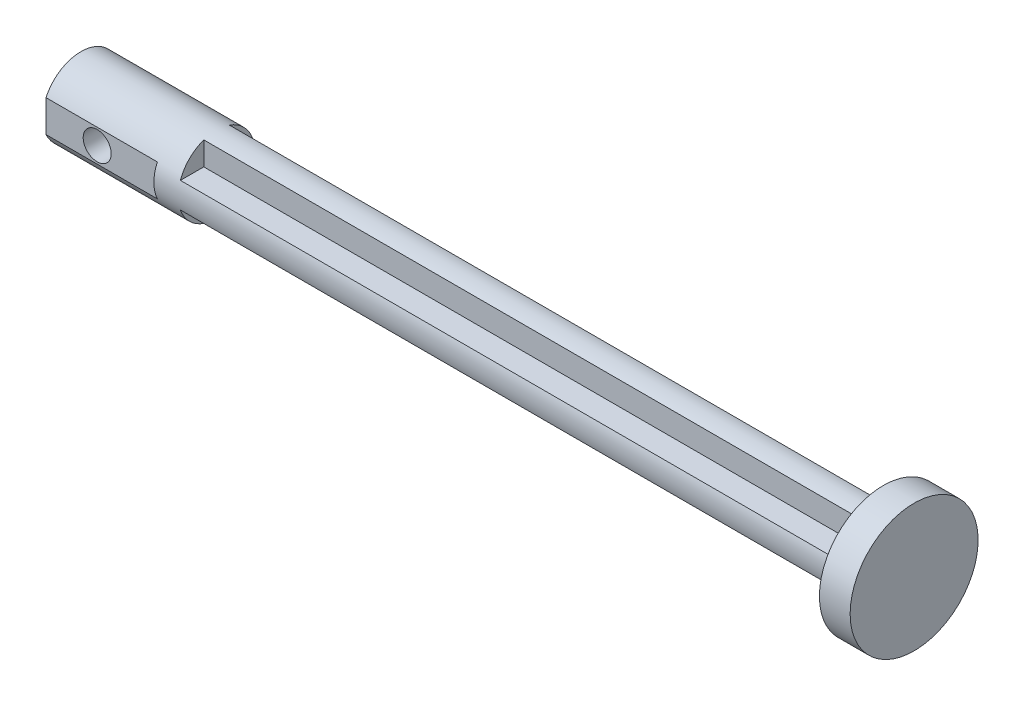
ISO-10303-21;
HEADER;
FILE_DESCRIPTION(('STEP AP214'),'2;1');
FILE_NAME('part.step','',(''),(''),'','','');
FILE_SCHEMA(('AUTOMOTIVE_DESIGN { 1 0 10303 214 1 1 1 1 }'));
ENDSEC;
DATA;
#1=APPLICATION_CONTEXT('core data for automotive mechanical design processes');
#2=APPLICATION_PROTOCOL_DEFINITION('international standard','automotive_design',2000,#1);
#3=PRODUCT_CONTEXT('',#1,'mechanical');
#4=PRODUCT('Part','Part','',(#3));
#5=PRODUCT_RELATED_PRODUCT_CATEGORY('part','',(#4));
#6=PRODUCT_DEFINITION_FORMATION('','',#4);
#7=PRODUCT_DEFINITION_CONTEXT('part definition',#1,'design');
#8=PRODUCT_DEFINITION('design','',#6,#7);
#9=PRODUCT_DEFINITION_SHAPE('','',#8);
#10=(LENGTH_UNIT() NAMED_UNIT(*) SI_UNIT(.MILLI.,.METRE.));
#11=(NAMED_UNIT(*) PLANE_ANGLE_UNIT() SI_UNIT($,.RADIAN.));
#12=(NAMED_UNIT(*) SI_UNIT($,.STERADIAN.) SOLID_ANGLE_UNIT());
#13=UNCERTAINTY_MEASURE_WITH_UNIT(LENGTH_MEASURE(1.E-05),#10,'distance_accuracy_value','');
#14=(GEOMETRIC_REPRESENTATION_CONTEXT(3) GLOBAL_UNCERTAINTY_ASSIGNED_CONTEXT((#13)) GLOBAL_UNIT_ASSIGNED_CONTEXT((#10,
#11,#12)) REPRESENTATION_CONTEXT('',''));
#15=CARTESIAN_POINT('',(0.,0.,0.));
#16=DIRECTION('',(0.,0.,1.));
#17=DIRECTION('',(1.,0.,0.));
#18=AXIS2_PLACEMENT_3D('',#15,#16,#17);
#19=CARTESIAN_POINT('',(13.462,0.,0.));
#20=DIRECTION('',(1.,0.,0.));
#21=DIRECTION('',(0.,0.,-1.));
#22=AXIS2_PLACEMENT_3D('',#19,#20,#21);
#23=PLANE('',#22);
#24=DIRECTION('',(0.,1.,0.));
#25=VECTOR('',#24,1.);
#26=CARTESIAN_POINT('',(13.462,1.27,-1.27));
#27=LINE('',#26,#25);
#28=CARTESIAN_POINT('',(13.462,1.27,-1.27));
#29=VERTEX_POINT('',#28);
#30=CARTESIAN_POINT('',(13.462,3.59210244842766,-1.27));
#31=VERTEX_POINT('',#30);
#32=EDGE_CURVE('E53',#29,#31,#27,.T.);
#33=ORIENTED_EDGE('',*,*,#32,.F.);
#34=DIRECTION('',(0.,0.,1.));
#35=VECTOR('',#34,1.);
#36=CARTESIAN_POINT('',(13.462,1.27,-3.59210244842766));
#37=LINE('',#36,#35);
#38=CARTESIAN_POINT('',(13.462,1.27,-3.59210244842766));
#39=VERTEX_POINT('',#38);
#40=EDGE_CURVE('E185',#39,#29,#37,.T.);
#41=ORIENTED_EDGE('',*,*,#40,.F.);
#42=CARTESIAN_POINT('',(13.462,0.,0.));
#43=DIRECTION('',(1.,0.,0.));
#44=DIRECTION('',(0.,0.,-1.));
#45=AXIS2_PLACEMENT_3D('',#42,#43,#44);
#46=CIRCLE('',#45,3.81);
#47=EDGE_CURVE('E11',#39,#31,#46,.T.);
#48=ORIENTED_EDGE('',*,*,#47,.T.);
#49=EDGE_LOOP('',(#33,#41,#48));
#50=FACE_BOUND('',#49,.T.);
#51=ADVANCED_FACE('F28',(#50),#23,.T.);
#52=DIRECTION('',(0.,0.,-1.));
#53=VECTOR('',#52,1.);
#54=CARTESIAN_POINT('',(13.462,-1.27,-1.27));
#55=LINE('',#54,#53);
#56=CARTESIAN_POINT('',(13.462,-1.27,-1.27));
#57=VERTEX_POINT('',#56);
#58=CARTESIAN_POINT('',(13.462,-1.27,-3.59210244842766));
#59=VERTEX_POINT('',#58);
#60=EDGE_CURVE('E195',#57,#59,#55,.T.);
#61=ORIENTED_EDGE('',*,*,#60,.F.);
#62=DIRECTION('',(0.,1.,0.));
#63=VECTOR('',#62,1.);
#64=CARTESIAN_POINT('',(13.462,-3.59210244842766,-1.27));
#65=LINE('',#64,#63);
#66=CARTESIAN_POINT('',(13.462,-3.59210244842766,-1.27));
#67=VERTEX_POINT('',#66);
#68=EDGE_CURVE('E203',#67,#57,#65,.T.);
#69=ORIENTED_EDGE('',*,*,#68,.F.);
#70=EDGE_CURVE('E146',#67,#59,#46,.T.);
#71=ORIENTED_EDGE('',*,*,#70,.T.);
#72=EDGE_LOOP('',(#61,#69,#71));
#73=FACE_BOUND('',#72,.T.);
#74=ADVANCED_FACE('F260',(#73),#23,.T.);
#75=DIRECTION('',(0.,-1.,0.));
#76=VECTOR('',#75,1.);
#77=CARTESIAN_POINT('',(13.462,-1.27,1.27));
#78=LINE('',#77,#76);
#79=CARTESIAN_POINT('',(13.462,-1.27,1.27));
#80=VERTEX_POINT('',#79);
#81=CARTESIAN_POINT('',(13.462,-3.59210244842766,1.27));
#82=VERTEX_POINT('',#81);
#83=EDGE_CURVE('E216',#80,#82,#78,.T.);
#84=ORIENTED_EDGE('',*,*,#83,.F.);
#85=DIRECTION('',(0.,0.,-1.));
#86=VECTOR('',#85,1.);
#87=CARTESIAN_POINT('',(13.462,-1.27,3.59210244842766));
#88=LINE('',#87,#86);
#89=CARTESIAN_POINT('',(13.462,-1.27,3.59210244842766));
#90=VERTEX_POINT('',#89);
#91=EDGE_CURVE('E222',#90,#80,#88,.T.);
#92=ORIENTED_EDGE('',*,*,#91,.F.);
#93=EDGE_CURVE('E149',#90,#82,#46,.T.);
#94=ORIENTED_EDGE('',*,*,#93,.T.);
#95=EDGE_LOOP('',(#84,#92,#94));
#96=FACE_BOUND('',#95,.T.);
#97=ADVANCED_FACE('F311',(#96),#23,.T.);
#98=CARTESIAN_POINT('',(13.462,0.,0.));
#99=DIRECTION('',(-1.,0.,0.));
#100=DIRECTION('',(0.,0.,1.));
#101=AXIS2_PLACEMENT_3D('',#98,#99,#100);
#102=CYLINDRICAL_SURFACE('',#101,3.81);
#103=ORIENTED_EDGE('',*,*,#47,.F.);
#104=DIRECTION('',(-1.,0.,0.));
#105=VECTOR('',#104,1.);
#106=CARTESIAN_POINT('',(90.405307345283,1.27,-3.59210244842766));
#107=LINE('',#106,#105);
#108=CARTESIAN_POINT('',(79.629,1.27,-3.59210244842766));
#109=VERTEX_POINT('',#108);
#110=EDGE_CURVE('E266',#109,#39,#107,.T.);
#111=ORIENTED_EDGE('',*,*,#110,.F.);
#112=CARTESIAN_POINT('',(79.629,0.,0.));
#113=DIRECTION('',(1.,0.,0.));
#114=DIRECTION('',(0.,0.,-1.));
#115=AXIS2_PLACEMENT_3D('',#112,#113,#114);
#116=CIRCLE('',#115,3.81);
#117=CARTESIAN_POINT('',(79.629,-1.27,-3.59210244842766));
#118=VERTEX_POINT('',#117);
#119=EDGE_CURVE('E152',#118,#109,#116,.T.);
#120=ORIENTED_EDGE('',*,*,#119,.F.);
#121=DIRECTION('',(-1.,0.,0.));
#122=VECTOR('',#121,1.);
#123=CARTESIAN_POINT('',(90.405307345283,-1.27,-3.59210244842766));
#124=LINE('',#123,#122);
#125=EDGE_CURVE('E199',#118,#59,#124,.T.);
#126=ORIENTED_EDGE('',*,*,#125,.T.);
#127=ORIENTED_EDGE('',*,*,#70,.F.);
#128=DIRECTION('',(-1.,0.,0.));
#129=VECTOR('',#128,1.);
#130=CARTESIAN_POINT('',(90.405307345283,-3.59210244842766,-1.27));
#131=LINE('',#130,#129);
#132=CARTESIAN_POINT('',(79.629,-3.59210244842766,-1.27));
#133=VERTEX_POINT('',#132);
#134=EDGE_CURVE('E206',#133,#67,#131,.T.);
#135=ORIENTED_EDGE('',*,*,#134,.F.);
#136=CARTESIAN_POINT('',(79.629,0.,0.));
#137=DIRECTION('',(1.,0.,0.));
#138=DIRECTION('',(0.,0.,-1.));
#139=AXIS2_PLACEMENT_3D('',#136,#137,#138);
#140=CIRCLE('',#139,3.81);
#141=CARTESIAN_POINT('',(79.629,-3.59210244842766,1.27));
#142=VERTEX_POINT('',#141);
#143=EDGE_CURVE('E288',#142,#133,#140,.T.);
#144=ORIENTED_EDGE('',*,*,#143,.F.);
#145=DIRECTION('',(-1.,0.,0.));
#146=VECTOR('',#145,1.);
#147=CARTESIAN_POINT('',(90.405307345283,-3.59210244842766,1.27));
#148=LINE('',#147,#146);
#149=EDGE_CURVE('E211',#142,#82,#148,.T.);
#150=ORIENTED_EDGE('',*,*,#149,.T.);
#151=ORIENTED_EDGE('',*,*,#93,.F.);
#152=DIRECTION('',(-1.,0.,0.));
#153=VECTOR('',#152,1.);
#154=CARTESIAN_POINT('',(90.405307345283,-1.27,3.59210244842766));
#155=LINE('',#154,#153);
#156=CARTESIAN_POINT('',(79.629,-1.27,3.59210244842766));
#157=VERTEX_POINT('',#156);
#158=EDGE_CURVE('E225',#157,#90,#155,.T.);
#159=ORIENTED_EDGE('',*,*,#158,.F.);
#160=CARTESIAN_POINT('',(79.629,0.,0.));
#161=DIRECTION('',(1.,0.,0.));
#162=DIRECTION('',(0.,0.,-1.));
#163=AXIS2_PLACEMENT_3D('',#160,#161,#162);
#164=CIRCLE('',#163,3.81);
#165=CARTESIAN_POINT('',(79.629,1.27,3.59210244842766));
#166=VERTEX_POINT('',#165);
#167=EDGE_CURVE('E296',#166,#157,#164,.T.);
#168=ORIENTED_EDGE('',*,*,#167,.F.);
#169=DIRECTION('',(-1.,0.,0.));
#170=VECTOR('',#169,1.);
#171=CARTESIAN_POINT('',(90.405307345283,1.27,3.59210244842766));
#172=LINE('',#171,#170);
#173=CARTESIAN_POINT('',(13.462,1.27,3.59210244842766));
#174=VERTEX_POINT('',#173);
#175=EDGE_CURVE('E230',#166,#174,#172,.T.);
#176=ORIENTED_EDGE('',*,*,#175,.T.);
#177=CARTESIAN_POINT('',(13.462,3.59210244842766,1.27));
#178=VERTEX_POINT('',#177);
#179=EDGE_CURVE('E38',#178,#174,#46,.T.);
#180=ORIENTED_EDGE('',*,*,#179,.F.);
#181=DIRECTION('',(-1.,0.,0.));
#182=VECTOR('',#181,1.);
#183=CARTESIAN_POINT('',(90.405307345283,3.59210244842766,1.27));
#184=LINE('',#183,#182);
#185=CARTESIAN_POINT('',(79.629,3.59210244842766,1.27));
#186=VERTEX_POINT('',#185);
#187=EDGE_CURVE('E169',#186,#178,#184,.T.);
#188=ORIENTED_EDGE('',*,*,#187,.F.);
#189=CARTESIAN_POINT('',(79.629,0.,0.));
#190=DIRECTION('',(1.,0.,0.));
#191=DIRECTION('',(0.,0.,-1.));
#192=AXIS2_PLACEMENT_3D('',#189,#190,#191);
#193=CIRCLE('',#192,3.81);
#194=CARTESIAN_POINT('',(79.629,3.59210244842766,-1.27));
#195=VERTEX_POINT('',#194);
#196=EDGE_CURVE('E303',#195,#186,#193,.T.);
#197=ORIENTED_EDGE('',*,*,#196,.F.);
#198=DIRECTION('',(-1.,0.,0.));
#199=VECTOR('',#198,1.);
#200=CARTESIAN_POINT('',(90.405307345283,3.59210244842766,-1.27));
#201=LINE('',#200,#199);
#202=EDGE_CURVE('E174',#195,#31,#201,.T.);
#203=ORIENTED_EDGE('',*,*,#202,.T.);
#204=EDGE_LOOP('',(#103,#111,#120,#126,#127,#135,#144,#150,#151,#159,#168,#176,#180,#188,#197,#203));
#205=FACE_BOUND('',#204,.T.);
#206=CARTESIAN_POINT('',(11.049,0.,0.));
#207=DIRECTION('',(-1.,0.,0.));
#208=DIRECTION('',(0.,0.,1.));
#209=AXIS2_PLACEMENT_3D('',#206,#207,#208);
#210=CIRCLE('',#209,3.81);
#211=CARTESIAN_POINT('',(11.049,-1.5875,3.46351609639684));
#212=VERTEX_POINT('',#211);
#213=CARTESIAN_POINT('',(11.049,1.5875,3.46351609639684));
#214=VERTEX_POINT('',#213);
#215=EDGE_CURVE('E137',#212,#214,#210,.T.);
#216=ORIENTED_EDGE('',*,*,#215,.F.);
#217=DIRECTION('',(-1.,0.,0.));
#218=VECTOR('',#217,1.);
#219=CARTESIAN_POINT('',(11.049,-1.5875,3.46351609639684));
#220=LINE('',#219,#218);
#221=CARTESIAN_POINT('',(0.,-1.5875,3.46351609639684));
#222=VERTEX_POINT('',#221);
#223=EDGE_CURVE('E132',#212,#222,#220,.T.);
#224=ORIENTED_EDGE('',*,*,#223,.T.);
#225=CARTESIAN_POINT('',(0.,0.,0.));
#226=DIRECTION('',(1.,0.,0.));
#227=DIRECTION('',(0.,0.,-1.));
#228=AXIS2_PLACEMENT_3D('',#225,#226,#227);
#229=CIRCLE('',#228,3.81);
#230=CARTESIAN_POINT('',(0.,1.5875,3.46351609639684));
#231=VERTEX_POINT('',#230);
#232=EDGE_CURVE('E142',#222,#231,#229,.T.);
#233=ORIENTED_EDGE('',*,*,#232,.T.);
#234=DIRECTION('',(-1.,0.,0.));
#235=VECTOR('',#234,1.);
#236=CARTESIAN_POINT('',(11.049,1.5875,3.46351609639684));
#237=LINE('',#236,#235);
#238=EDGE_CURVE('E46',#214,#231,#237,.T.);
#239=ORIENTED_EDGE('',*,*,#238,.F.);
#240=EDGE_LOOP('',(#216,#224,#233,#239));
#241=FACE_BOUND('',#240,.T.);
#242=ADVANCED_FACE('F30',(#205,#241),#102,.T.);
#243=DIRECTION('',(0.,0.,1.));
#244=VECTOR('',#243,1.);
#245=CARTESIAN_POINT('',(13.462,1.27,1.27));
#246=LINE('',#245,#244);
#247=CARTESIAN_POINT('',(13.462,1.27,1.27));
#248=VERTEX_POINT('',#247);
#249=EDGE_CURVE('E32',#248,#174,#246,.T.);
#250=ORIENTED_EDGE('',*,*,#249,.F.);
#251=DIRECTION('',(0.,-1.,0.));
#252=VECTOR('',#251,1.);
#253=CARTESIAN_POINT('',(13.462,3.59210244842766,1.27));
#254=LINE('',#253,#252);
#255=EDGE_CURVE('E165',#178,#248,#254,.T.);
#256=ORIENTED_EDGE('',*,*,#255,.F.);
#257=ORIENTED_EDGE('',*,*,#179,.T.);
#258=EDGE_LOOP('',(#250,#256,#257));
#259=FACE_BOUND('',#258,.T.);
#260=ADVANCED_FACE('F309',(#259),#23,.T.);
#261=CARTESIAN_POINT('',(0.,0.,0.));
#262=DIRECTION('',(1.,0.,0.));
#263=DIRECTION('',(0.,0.,-1.));
#264=AXIS2_PLACEMENT_3D('',#261,#262,#263);
#265=PLANE('',#264);
#266=ORIENTED_EDGE('',*,*,#232,.F.);
#267=DIRECTION('',(0.,-1.,0.));
#268=VECTOR('',#267,1.);
#269=CARTESIAN_POINT('',(0.,1.5875,3.46351609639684));
#270=LINE('',#269,#268);
#271=EDGE_CURVE('E129',#231,#222,#270,.T.);
#272=ORIENTED_EDGE('',*,*,#271,.F.);
#273=EDGE_LOOP('',(#266,#272));
#274=FACE_BOUND('',#273,.T.);
#275=ADVANCED_FACE('F145',(#274),#265,.F.);
#276=CARTESIAN_POINT('',(90.405307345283,3.59210244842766,1.27));
#277=DIRECTION('',(0.,0.,-1.));
#278=DIRECTION('',(0.,1.,0.));
#279=AXIS2_PLACEMENT_3D('',#276,#277,#278);
#280=PLANE('',#279);
#281=DIRECTION('',(0.,-1.,0.));
#282=VECTOR('',#281,1.);
#283=CARTESIAN_POINT('',(79.629,3.59210244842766,1.27));
#284=LINE('',#283,#282);
#285=CARTESIAN_POINT('',(79.629,1.27,1.27));
#286=VERTEX_POINT('',#285);
#287=EDGE_CURVE('E301',#186,#286,#284,.T.);
#288=ORIENTED_EDGE('',*,*,#287,.F.);
#289=ORIENTED_EDGE('',*,*,#187,.T.);
#290=ORIENTED_EDGE('',*,*,#255,.T.);
#291=DIRECTION('',(-1.,0.,0.));
#292=VECTOR('',#291,1.);
#293=CARTESIAN_POINT('',(90.405307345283,1.27,1.27));
#294=LINE('',#293,#292);
#295=EDGE_CURVE('E168',#286,#248,#294,.T.);
#296=ORIENTED_EDGE('',*,*,#295,.F.);
#297=EDGE_LOOP('',(#288,#289,#290,#296));
#298=FACE_BOUND('',#297,.T.);
#299=ADVANCED_FACE('F307',(#298),#280,.F.);
#300=CARTESIAN_POINT('',(90.405307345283,1.27,1.27));
#301=DIRECTION('',(0.,-1.,0.));
#302=DIRECTION('',(0.,0.,-1.));
#303=AXIS2_PLACEMENT_3D('',#300,#301,#302);
#304=PLANE('',#303);
#305=DIRECTION('',(0.,0.,1.));
#306=VECTOR('',#305,1.);
#307=CARTESIAN_POINT('',(79.629,1.27,1.27));
#308=LINE('',#307,#306);
#309=EDGE_CURVE('E299',#286,#166,#308,.T.);
#310=ORIENTED_EDGE('',*,*,#309,.F.);
#311=ORIENTED_EDGE('',*,*,#295,.T.);
#312=ORIENTED_EDGE('',*,*,#249,.T.);
#313=ORIENTED_EDGE('',*,*,#175,.F.);
#314=EDGE_LOOP('',(#310,#311,#312,#313));
#315=FACE_BOUND('',#314,.T.);
#316=ADVANCED_FACE('F332',(#315),#304,.F.);
#317=CARTESIAN_POINT('',(90.405307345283,-1.27,3.59210244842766));
#318=DIRECTION('',(0.,1.,0.));
#319=DIRECTION('',(0.,0.,1.));
#320=AXIS2_PLACEMENT_3D('',#317,#318,#319);
#321=PLANE('',#320);
#322=DIRECTION('',(0.,0.,-1.));
#323=VECTOR('',#322,1.);
#324=CARTESIAN_POINT('',(79.629,-1.27,3.59210244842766));
#325=LINE('',#324,#323);
#326=CARTESIAN_POINT('',(79.629,-1.27,1.27));
#327=VERTEX_POINT('',#326);
#328=EDGE_CURVE('E293',#157,#327,#325,.T.);
#329=ORIENTED_EDGE('',*,*,#328,.F.);
#330=ORIENTED_EDGE('',*,*,#158,.T.);
#331=ORIENTED_EDGE('',*,*,#91,.T.);
#332=DIRECTION('',(-1.,0.,0.));
#333=VECTOR('',#332,1.);
#334=CARTESIAN_POINT('',(90.405307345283,-1.27,1.27));
#335=LINE('',#334,#333);
#336=EDGE_CURVE('E221',#327,#80,#335,.T.);
#337=ORIENTED_EDGE('',*,*,#336,.F.);
#338=EDGE_LOOP('',(#329,#330,#331,#337));
#339=FACE_BOUND('',#338,.T.);
#340=ADVANCED_FACE('F330',(#339),#321,.F.);
#341=CARTESIAN_POINT('',(90.405307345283,-1.27,1.27));
#342=DIRECTION('',(0.,0.,-1.));
#343=DIRECTION('',(0.,1.,0.));
#344=AXIS2_PLACEMENT_3D('',#341,#342,#343);
#345=PLANE('',#344);
#346=DIRECTION('',(0.,-1.,0.));
#347=VECTOR('',#346,1.);
#348=CARTESIAN_POINT('',(79.629,-1.27,1.27));
#349=LINE('',#348,#347);
#350=EDGE_CURVE('E290',#327,#142,#349,.T.);
#351=ORIENTED_EDGE('',*,*,#350,.F.);
#352=ORIENTED_EDGE('',*,*,#336,.T.);
#353=ORIENTED_EDGE('',*,*,#83,.T.);
#354=ORIENTED_EDGE('',*,*,#149,.F.);
#355=EDGE_LOOP('',(#351,#352,#353,#354));
#356=FACE_BOUND('',#355,.T.);
#357=ADVANCED_FACE('F328',(#356),#345,.F.);
#358=CARTESIAN_POINT('',(90.405307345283,-3.59210244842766,-1.27));
#359=DIRECTION('',(0.,0.,1.));
#360=DIRECTION('',(0.,-1.,0.));
#361=AXIS2_PLACEMENT_3D('',#358,#359,#360);
#362=PLANE('',#361);
#363=DIRECTION('',(0.,1.,0.));
#364=VECTOR('',#363,1.);
#365=CARTESIAN_POINT('',(79.629,-3.59210244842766,-1.27));
#366=LINE('',#365,#364);
#367=CARTESIAN_POINT('',(79.629,-1.27,-1.27));
#368=VERTEX_POINT('',#367);
#369=EDGE_CURVE('E284',#133,#368,#366,.T.);
#370=ORIENTED_EDGE('',*,*,#369,.F.);
#371=ORIENTED_EDGE('',*,*,#134,.T.);
#372=ORIENTED_EDGE('',*,*,#68,.T.);
#373=DIRECTION('',(-1.,0.,0.));
#374=VECTOR('',#373,1.);
#375=CARTESIAN_POINT('',(90.405307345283,-1.27,-1.27));
#376=LINE('',#375,#374);
#377=EDGE_CURVE('E200',#368,#57,#376,.T.);
#378=ORIENTED_EDGE('',*,*,#377,.F.);
#379=EDGE_LOOP('',(#370,#371,#372,#378));
#380=FACE_BOUND('',#379,.T.);
#381=ADVANCED_FACE('F256',(#380),#362,.F.);
#382=CARTESIAN_POINT('',(90.405307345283,-1.27,-1.27));
#383=DIRECTION('',(0.,1.,0.));
#384=DIRECTION('',(0.,0.,1.));
#385=AXIS2_PLACEMENT_3D('',#382,#383,#384);
#386=PLANE('',#385);
#387=DIRECTION('',(0.,0.,-1.));
#388=VECTOR('',#387,1.);
#389=CARTESIAN_POINT('',(79.629,-1.27,-1.27));
#390=LINE('',#389,#388);
#391=EDGE_CURVE('E253',#368,#118,#390,.T.);
#392=ORIENTED_EDGE('',*,*,#391,.F.);
#393=ORIENTED_EDGE('',*,*,#377,.T.);
#394=ORIENTED_EDGE('',*,*,#60,.T.);
#395=ORIENTED_EDGE('',*,*,#125,.F.);
#396=EDGE_LOOP('',(#392,#393,#394,#395));
#397=FACE_BOUND('',#396,.T.);
#398=ADVANCED_FACE('F250',(#397),#386,.F.);
#399=CARTESIAN_POINT('',(90.405307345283,1.27,-3.59210244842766));
#400=DIRECTION('',(0.,-1.,0.));
#401=DIRECTION('',(0.,0.,-1.));
#402=AXIS2_PLACEMENT_3D('',#399,#400,#401);
#403=PLANE('',#402);
#404=DIRECTION('',(0.,0.,1.));
#405=VECTOR('',#404,1.);
#406=CARTESIAN_POINT('',(79.629,1.27,-3.59210244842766));
#407=LINE('',#406,#405);
#408=CARTESIAN_POINT('',(79.629,1.27,-1.27));
#409=VERTEX_POINT('',#408);
#410=EDGE_CURVE('E147',#109,#409,#407,.T.);
#411=ORIENTED_EDGE('',*,*,#410,.F.);
#412=ORIENTED_EDGE('',*,*,#110,.T.);
#413=ORIENTED_EDGE('',*,*,#40,.T.);
#414=DIRECTION('',(-1.,0.,0.));
#415=VECTOR('',#414,1.);
#416=CARTESIAN_POINT('',(90.405307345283,1.27,-1.27));
#417=LINE('',#416,#415);
#418=EDGE_CURVE('E155',#409,#29,#417,.T.);
#419=ORIENTED_EDGE('',*,*,#418,.F.);
#420=EDGE_LOOP('',(#411,#412,#413,#419));
#421=FACE_BOUND('',#420,.T.);
#422=ADVANCED_FACE('F279',(#421),#403,.F.);
#423=CARTESIAN_POINT('',(90.405307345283,1.27,-1.27));
#424=DIRECTION('',(0.,0.,1.));
#425=DIRECTION('',(0.,-1.,0.));
#426=AXIS2_PLACEMENT_3D('',#423,#424,#425);
#427=PLANE('',#426);
#428=DIRECTION('',(0.,1.,0.));
#429=VECTOR('',#428,1.);
#430=CARTESIAN_POINT('',(79.629,1.27,-1.27));
#431=LINE('',#430,#429);
#432=EDGE_CURVE('E184',#409,#195,#431,.T.);
#433=ORIENTED_EDGE('',*,*,#432,.F.);
#434=ORIENTED_EDGE('',*,*,#418,.T.);
#435=ORIENTED_EDGE('',*,*,#32,.T.);
#436=ORIENTED_EDGE('',*,*,#202,.F.);
#437=EDGE_LOOP('',(#433,#434,#435,#436));
#438=FACE_BOUND('',#437,.T.);
#439=ADVANCED_FACE('F276',(#438),#427,.F.);
#440=CARTESIAN_POINT('',(79.629,0.,0.));
#441=DIRECTION('',(1.,0.,0.));
#442=DIRECTION('',(0.,0.,-1.));
#443=AXIS2_PLACEMENT_3D('',#440,#441,#442);
#444=PLANE('',#443);
#445=CARTESIAN_POINT('',(79.629,0.,0.));
#446=DIRECTION('',(1.,0.,0.));
#447=DIRECTION('',(0.,0.,-1.));
#448=AXIS2_PLACEMENT_3D('',#445,#446,#447);
#449=CIRCLE('',#448,6.35);
#450=CARTESIAN_POINT('',(79.629,0.,6.35));
#451=VERTEX_POINT('',#450);
#452=EDGE_CURVE('E143',#451,#451,#449,.T.);
#453=ORIENTED_EDGE('',*,*,#452,.F.);
#454=EDGE_LOOP('',(#453));
#455=FACE_BOUND('',#454,.T.);
#456=ORIENTED_EDGE('',*,*,#309,.T.);
#457=ORIENTED_EDGE('',*,*,#167,.T.);
#458=ORIENTED_EDGE('',*,*,#328,.T.);
#459=ORIENTED_EDGE('',*,*,#350,.T.);
#460=ORIENTED_EDGE('',*,*,#143,.T.);
#461=ORIENTED_EDGE('',*,*,#369,.T.);
#462=ORIENTED_EDGE('',*,*,#391,.T.);
#463=ORIENTED_EDGE('',*,*,#119,.T.);
#464=ORIENTED_EDGE('',*,*,#410,.T.);
#465=ORIENTED_EDGE('',*,*,#432,.T.);
#466=ORIENTED_EDGE('',*,*,#196,.T.);
#467=ORIENTED_EDGE('',*,*,#287,.T.);
#468=EDGE_LOOP('',(#456,#457,#458,#459,#460,#461,#462,#463,#464,#465,#466,#467));
#469=FACE_BOUND('',#468,.T.);
#470=ADVANCED_FACE('F282',(#455,#469),#444,.F.);
#471=CARTESIAN_POINT('',(82.677,0.,0.));
#472=DIRECTION('',(-1.,0.,0.));
#473=DIRECTION('',(0.,0.,1.));
#474=AXIS2_PLACEMENT_3D('',#471,#472,#473);
#475=CYLINDRICAL_SURFACE('',#474,6.35);
#476=CARTESIAN_POINT('',(82.677,0.,0.));
#477=DIRECTION('',(1.,0.,0.));
#478=DIRECTION('',(0.,0.,-1.));
#479=AXIS2_PLACEMENT_3D('',#476,#477,#478);
#480=CIRCLE('',#479,6.35);
#481=CARTESIAN_POINT('',(82.677,0.,6.35));
#482=VERTEX_POINT('',#481);
#483=EDGE_CURVE('E179',#482,#482,#480,.T.);
#484=CARTESIAN_POINT('',(82.677,0.,6.35));
#485=CARTESIAN_POINT('',(82.64525,0.,6.35));
#486=CARTESIAN_POINT('',(82.6135,0.,6.35));
#487=CARTESIAN_POINT('',(82.55,0.,6.35));
#488=CARTESIAN_POINT('',(82.51825,0.,6.35));
#489=CARTESIAN_POINT('',(82.45475,0.,6.35));
#490=CARTESIAN_POINT('',(82.423,0.,6.35));
#491=CARTESIAN_POINT('',(82.3595,0.,6.35));
#492=CARTESIAN_POINT('',(82.32775,0.,6.35));
#493=CARTESIAN_POINT('',(82.26425,0.,6.35));
#494=CARTESIAN_POINT('',(82.2325,0.,6.35));
#495=CARTESIAN_POINT('',(82.169,0.,6.35));
#496=CARTESIAN_POINT('',(82.13725,0.,6.35));
#497=CARTESIAN_POINT('',(82.07375,0.,6.35));
#498=CARTESIAN_POINT('',(82.042,0.,6.35));
#499=CARTESIAN_POINT('',(81.9785,0.,6.35));
#500=CARTESIAN_POINT('',(81.94675,0.,6.35));
#501=CARTESIAN_POINT('',(81.88325,0.,6.35));
#502=CARTESIAN_POINT('',(81.8515,0.,6.35));
#503=CARTESIAN_POINT('',(81.788,0.,6.35));
#504=CARTESIAN_POINT('',(81.75625,0.,6.35));
#505=CARTESIAN_POINT('',(81.69275,0.,6.35));
#506=CARTESIAN_POINT('',(81.661,0.,6.35));
#507=CARTESIAN_POINT('',(81.5975,0.,6.35));
#508=CARTESIAN_POINT('',(81.56575,0.,6.35));
#509=CARTESIAN_POINT('',(81.50225,0.,6.35));
#510=CARTESIAN_POINT('',(81.4705,0.,6.35));
#511=CARTESIAN_POINT('',(81.407,0.,6.35));
#512=CARTESIAN_POINT('',(81.37525,0.,6.35));
#513=CARTESIAN_POINT('',(81.31175,0.,6.35));
#514=CARTESIAN_POINT('',(81.28,0.,6.35));
#515=CARTESIAN_POINT('',(81.2165,0.,6.35));
#516=CARTESIAN_POINT('',(81.18475,0.,6.35));
#517=CARTESIAN_POINT('',(81.12125,0.,6.35));
#518=CARTESIAN_POINT('',(81.0895,0.,6.35));
#519=CARTESIAN_POINT('',(81.026,0.,6.35));
#520=CARTESIAN_POINT('',(80.99425,0.,6.35));
#521=CARTESIAN_POINT('',(80.93075,0.,6.35));
#522=CARTESIAN_POINT('',(80.899,0.,6.35));
#523=CARTESIAN_POINT('',(80.8355,0.,6.35));
#524=CARTESIAN_POINT('',(80.80375,0.,6.35));
#525=CARTESIAN_POINT('',(80.74025,0.,6.35));
#526=CARTESIAN_POINT('',(80.7085,0.,6.35));
#527=CARTESIAN_POINT('',(80.645,0.,6.35));
#528=CARTESIAN_POINT('',(80.61325,0.,6.35));
#529=CARTESIAN_POINT('',(80.54975,0.,6.35));
#530=CARTESIAN_POINT('',(80.518,0.,6.35));
#531=CARTESIAN_POINT('',(80.4545,0.,6.35));
#532=CARTESIAN_POINT('',(80.42275,0.,6.35));
#533=CARTESIAN_POINT('',(80.35925,0.,6.35));
#534=CARTESIAN_POINT('',(80.3275,0.,6.35));
#535=CARTESIAN_POINT('',(80.264,0.,6.35));
#536=CARTESIAN_POINT('',(80.23225,0.,6.35));
#537=CARTESIAN_POINT('',(80.16875,0.,6.35));
#538=CARTESIAN_POINT('',(80.137,0.,6.35));
#539=CARTESIAN_POINT('',(80.0735,0.,6.35));
#540=CARTESIAN_POINT('',(80.04175,0.,6.35));
#541=CARTESIAN_POINT('',(79.97825,0.,6.35));
#542=CARTESIAN_POINT('',(79.9465,0.,6.35));
#543=CARTESIAN_POINT('',(79.883,0.,6.35));
#544=CARTESIAN_POINT('',(79.85125,0.,6.35));
#545=CARTESIAN_POINT('',(79.78775,0.,6.35));
#546=CARTESIAN_POINT('',(79.756,0.,6.35));
#547=CARTESIAN_POINT('',(79.6925,0.,6.35));
#548=CARTESIAN_POINT('',(79.66075,0.,6.35));
#549=CARTESIAN_POINT('',(79.629,0.,6.35));
#550=B_SPLINE_CURVE_WITH_KNOTS('',3,(#484,#485,#486,#487,#488,#489,#490,#491,#492,#493,#494,
#495,#496,#497,#498,#499,#500,#501,#502,#503,#504,#505,#506,#507,#508,#509,#510,#511,#512,#513,
#514,#515,#516,#517,#518,#519,#520,#521,#522,#523,#524,#525,#526,#527,#528,#529,#530,#531,#532,
#533,#534,#535,#536,#537,#538,#539,#540,#541,#542,#543,#544,#545,#546,#547,#548,#549),
.UNSPECIFIED.,.F.,.F.,(4,2,2,2,2,2,2,2,2,2,2,2,2,2,2,2,2,2,2,2,2,2,2,2,2,2,2,2,2,2,2,2,4),(0.,
0.0952499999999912,0.190499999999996,0.285749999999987,0.380999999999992,0.476249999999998,
0.571499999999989,0.666749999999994,0.761999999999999,0.85724999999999,0.952499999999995,
1.04774999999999,1.14299999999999,1.23825,1.33349999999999,1.42874999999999,1.524,
1.61924999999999,1.71449999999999,1.80974999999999,1.90499999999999,2.00024999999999,
2.09549999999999,2.19074999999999,2.286,2.38124999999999,2.47649999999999,2.57174999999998,
2.66699999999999,2.76224999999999,2.85749999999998,2.95274999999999,3.048),.UNSPECIFIED.);
#551=EDGE_CURVE('BSEAM351',#482,#451,#550,.T.);
#552=ORIENTED_EDGE('',*,*,#483,.F.);
#553=ORIENTED_EDGE('',*,*,#452,.T.);
#554=ORIENTED_EDGE('',*,*,#551,.T.);
#555=ORIENTED_EDGE('',*,*,#551,.F.);
#556=EDGE_LOOP('',(#552,#554,#553,#555));
#557=FACE_BOUND('',#556,.T.);
#558=ADVANCED_FACE('F351',(#557),#475,.T.);
#559=CARTESIAN_POINT('',(82.677,0.,0.));
#560=DIRECTION('',(1.,0.,0.));
#561=DIRECTION('',(0.,0.,-1.));
#562=AXIS2_PLACEMENT_3D('',#559,#560,#561);
#563=PLANE('',#562);
#564=ORIENTED_EDGE('',*,*,#483,.T.);
#565=EDGE_LOOP('',(#564));
#566=FACE_BOUND('',#565,.T.);
#567=ADVANCED_FACE('F354',(#566),#563,.T.);
#568=CARTESIAN_POINT('',(11.049,1.5875,3.46351609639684));
#569=DIRECTION('',(0.,0.,-1.));
#570=DIRECTION('',(0.,1.,0.));
#571=AXIS2_PLACEMENT_3D('',#568,#569,#570);
#572=PLANE('',#571);
#573=CARTESIAN_POINT('',(5.08,0.,3.46351609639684));
#574=DIRECTION('',(0.,0.,1.));
#575=DIRECTION('',(1.,0.,0.));
#576=AXIS2_PLACEMENT_3D('',#573,#574,#575);
#577=CIRCLE('',#576,1.3890625);
#578=CARTESIAN_POINT('',(6.4690625,0.,3.46351609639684));
#579=VERTEX_POINT('',#578);
#580=EDGE_CURVE('E380',#579,#579,#577,.T.);
#581=ORIENTED_EDGE('',*,*,#580,.F.);
#582=EDGE_LOOP('',(#581));
#583=FACE_BOUND('',#582,.T.);
#584=ORIENTED_EDGE('',*,*,#271,.T.);
#585=ORIENTED_EDGE('',*,*,#223,.F.);
#586=DIRECTION('',(0.,-1.,0.));
#587=VECTOR('',#586,1.);
#588=CARTESIAN_POINT('',(11.049,1.5875,3.46351609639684));
#589=LINE('',#588,#587);
#590=EDGE_CURVE('E386',#214,#212,#589,.T.);
#591=ORIENTED_EDGE('',*,*,#590,.F.);
#592=ORIENTED_EDGE('',*,*,#238,.T.);
#593=EDGE_LOOP('',(#584,#585,#591,#592));
#594=FACE_BOUND('',#593,.T.);
#595=ADVANCED_FACE('F131',(#583,#594),#572,.F.);
#596=CARTESIAN_POINT('',(11.049,0.,0.));
#597=DIRECTION('',(-1.,0.,0.));
#598=DIRECTION('',(0.,0.,1.));
#599=AXIS2_PLACEMENT_3D('',#596,#597,#598);
#600=PLANE('',#599);
#601=ORIENTED_EDGE('',*,*,#215,.T.);
#602=ORIENTED_EDGE('',*,*,#590,.T.);
#603=EDGE_LOOP('',(#601,#602));
#604=FACE_BOUND('',#603,.T.);
#605=ADVANCED_FACE('F364',(#604),#600,.T.);
#606=CARTESIAN_POINT('',(5.08,0.,-0.346483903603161));
#607=DIRECTION('',(0.,0.,1.));
#608=DIRECTION('',(1.,0.,0.));
#609=AXIS2_PLACEMENT_3D('',#606,#607,#608);
#610=CYLINDRICAL_SURFACE('',#609,1.3890625);
#611=CARTESIAN_POINT('',(5.08,0.,-0.346483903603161));
#612=DIRECTION('',(0.,0.,1.));
#613=DIRECTION('',(1.,0.,0.));
#614=AXIS2_PLACEMENT_3D('',#611,#612,#613);
#615=CIRCLE('',#614,1.3890625);
#616=CARTESIAN_POINT('',(6.4690625,0.,-0.346483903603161));
#617=VERTEX_POINT('',#616);
#618=EDGE_CURVE('E138',#617,#617,#615,.T.);
#619=CARTESIAN_POINT('',(6.4690625,0.,-0.346483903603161));
#620=CARTESIAN_POINT('',(6.4690625,0.,-0.306796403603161));
#621=CARTESIAN_POINT('',(6.4690625,0.,-0.267108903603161));
#622=CARTESIAN_POINT('',(6.4690625,0.,-0.187733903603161));
#623=CARTESIAN_POINT('',(6.4690625,0.,-0.148046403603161));
#624=CARTESIAN_POINT('',(6.4690625,0.,-0.068671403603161));
#625=CARTESIAN_POINT('',(6.4690625,0.,-0.028983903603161));
#626=CARTESIAN_POINT('',(6.4690625,0.,0.050391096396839));
#627=CARTESIAN_POINT('',(6.4690625,0.,0.0900785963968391));
#628=CARTESIAN_POINT('',(6.4690625,0.,0.169453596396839));
#629=CARTESIAN_POINT('',(6.4690625,0.,0.209141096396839));
#630=CARTESIAN_POINT('',(6.4690625,0.,0.288516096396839));
#631=CARTESIAN_POINT('',(6.4690625,0.,0.328203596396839));
#632=CARTESIAN_POINT('',(6.4690625,0.,0.407578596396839));
#633=CARTESIAN_POINT('',(6.4690625,0.,0.447266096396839));
#634=CARTESIAN_POINT('',(6.4690625,0.,0.526641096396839));
#635=CARTESIAN_POINT('',(6.4690625,0.,0.566328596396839));
#636=CARTESIAN_POINT('',(6.4690625,0.,0.645703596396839));
#637=CARTESIAN_POINT('',(6.4690625,0.,0.685391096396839));
#638=CARTESIAN_POINT('',(6.4690625,0.,0.764766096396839));
#639=CARTESIAN_POINT('',(6.4690625,0.,0.804453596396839));
#640=CARTESIAN_POINT('',(6.4690625,0.,0.883828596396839));
#641=CARTESIAN_POINT('',(6.4690625,0.,0.923516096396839));
#642=CARTESIAN_POINT('',(6.4690625,0.,1.00289109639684));
#643=CARTESIAN_POINT('',(6.4690625,0.,1.04257859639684));
#644=CARTESIAN_POINT('',(6.4690625,0.,1.12195359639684));
#645=CARTESIAN_POINT('',(6.4690625,0.,1.16164109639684));
#646=CARTESIAN_POINT('',(6.4690625,0.,1.24101609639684));
#647=CARTESIAN_POINT('',(6.4690625,0.,1.28070359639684));
#648=CARTESIAN_POINT('',(6.4690625,0.,1.36007859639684));
#649=CARTESIAN_POINT('',(6.4690625,0.,1.39976609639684));
#650=CARTESIAN_POINT('',(6.4690625,0.,1.47914109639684));
#651=CARTESIAN_POINT('',(6.4690625,0.,1.51882859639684));
#652=CARTESIAN_POINT('',(6.4690625,0.,1.59820359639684));
#653=CARTESIAN_POINT('',(6.4690625,0.,1.63789109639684));
#654=CARTESIAN_POINT('',(6.4690625,0.,1.71726609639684));
#655=CARTESIAN_POINT('',(6.4690625,0.,1.75695359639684));
#656=CARTESIAN_POINT('',(6.4690625,0.,1.83632859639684));
#657=CARTESIAN_POINT('',(6.4690625,0.,1.87601609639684));
#658=CARTESIAN_POINT('',(6.4690625,0.,1.95539109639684));
#659=CARTESIAN_POINT('',(6.4690625,0.,1.99507859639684));
#660=CARTESIAN_POINT('',(6.4690625,0.,2.07445359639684));
#661=CARTESIAN_POINT('',(6.4690625,0.,2.11414109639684));
#662=CARTESIAN_POINT('',(6.4690625,0.,2.19351609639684));
#663=CARTESIAN_POINT('',(6.4690625,0.,2.23320359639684));
#664=CARTESIAN_POINT('',(6.4690625,0.,2.31257859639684));
#665=CARTESIAN_POINT('',(6.4690625,0.,2.35226609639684));
#666=CARTESIAN_POINT('',(6.4690625,0.,2.43164109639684));
#667=CARTESIAN_POINT('',(6.4690625,0.,2.47132859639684));
#668=CARTESIAN_POINT('',(6.4690625,0.,2.55070359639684));
#669=CARTESIAN_POINT('',(6.4690625,0.,2.59039109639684));
#670=CARTESIAN_POINT('',(6.4690625,0.,2.66976609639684));
#671=CARTESIAN_POINT('',(6.4690625,0.,2.70945359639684));
#672=CARTESIAN_POINT('',(6.4690625,0.,2.78882859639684));
#673=CARTESIAN_POINT('',(6.4690625,0.,2.82851609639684));
#674=CARTESIAN_POINT('',(6.4690625,0.,2.90789109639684));
#675=CARTESIAN_POINT('',(6.4690625,0.,2.94757859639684));
#676=CARTESIAN_POINT('',(6.4690625,0.,3.02695359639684));
#677=CARTESIAN_POINT('',(6.4690625,0.,3.06664109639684));
#678=CARTESIAN_POINT('',(6.4690625,0.,3.14601609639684));
#679=CARTESIAN_POINT('',(6.4690625,0.,3.18570359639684));
#680=CARTESIAN_POINT('',(6.4690625,0.,3.26507859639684));
#681=CARTESIAN_POINT('',(6.4690625,0.,3.30476609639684));
#682=CARTESIAN_POINT('',(6.4690625,0.,3.38414109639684));
#683=CARTESIAN_POINT('',(6.4690625,0.,3.42382859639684));
#684=CARTESIAN_POINT('',(6.4690625,0.,3.46351609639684));
#685=B_SPLINE_CURVE_WITH_KNOTS('',3,(#619,#620,#621,#622,#623,#624,#625,#626,#627,#628,#629,
#630,#631,#632,#633,#634,#635,#636,#637,#638,#639,#640,#641,#642,#643,#644,#645,#646,#647,#648,
#649,#650,#651,#652,#653,#654,#655,#656,#657,#658,#659,#660,#661,#662,#663,#664,#665,#666,#667,
#668,#669,#670,#671,#672,#673,#674,#675,#676,#677,#678,#679,#680,#681,#682,#683,#684),
.UNSPECIFIED.,.F.,.F.,(4,2,2,2,2,2,2,2,2,2,2,2,2,2,2,2,2,2,2,2,2,2,2,2,2,2,2,2,2,2,2,2,4),(0.,
0.1190625,0.238125,0.3571875,0.47625,0.5953125,0.714375,0.8334375,0.9525,1.0715625,1.190625,
1.3096875,1.42875,1.5478125,1.666875,1.7859375,1.905,2.0240625,2.143125,2.2621875,2.38125,
2.5003125,2.619375,2.7384375,2.8575,2.9765625,3.095625,3.2146875,3.33375,3.4528125,3.571875,
3.6909375,3.81),.UNSPECIFIED.);
#686=EDGE_CURVE('BSEAM368',#617,#579,#685,.T.);
#687=ORIENTED_EDGE('',*,*,#618,.F.);
#688=ORIENTED_EDGE('',*,*,#580,.T.);
#689=ORIENTED_EDGE('',*,*,#686,.T.);
#690=ORIENTED_EDGE('',*,*,#686,.F.);
#691=EDGE_LOOP('',(#687,#689,#688,#690));
#692=FACE_BOUND('',#691,.T.);
#693=ADVANCED_FACE('F368',(#692),#610,.F.);
#694=CARTESIAN_POINT('',(5.08,0.,-0.346483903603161));
#695=DIRECTION('',(0.,0.,1.));
#696=DIRECTION('',(1.,0.,0.));
#697=AXIS2_PLACEMENT_3D('',#694,#695,#696);
#698=PLANE('',#697);
#699=ORIENTED_EDGE('',*,*,#618,.T.);
#700=EDGE_LOOP('',(#699));
#701=FACE_BOUND('',#700,.T.);
#702=ADVANCED_FACE('F372',(#701),#698,.T.);
#703=CLOSED_SHELL('',(#51,#74,#97,#242,#260,#275,#299,#316,#340,#357,#381,#398,#422,#439,#470,
#558,#567,#595,#605,#693,#702));
#704=MANIFOLD_SOLID_BREP('B2',#703);
#705=ADVANCED_BREP_SHAPE_REPRESENTATION('',(#18,#704),#14);
#706=SHAPE_DEFINITION_REPRESENTATION(#9,#705);
ENDSEC;
END-ISO-10303-21;
